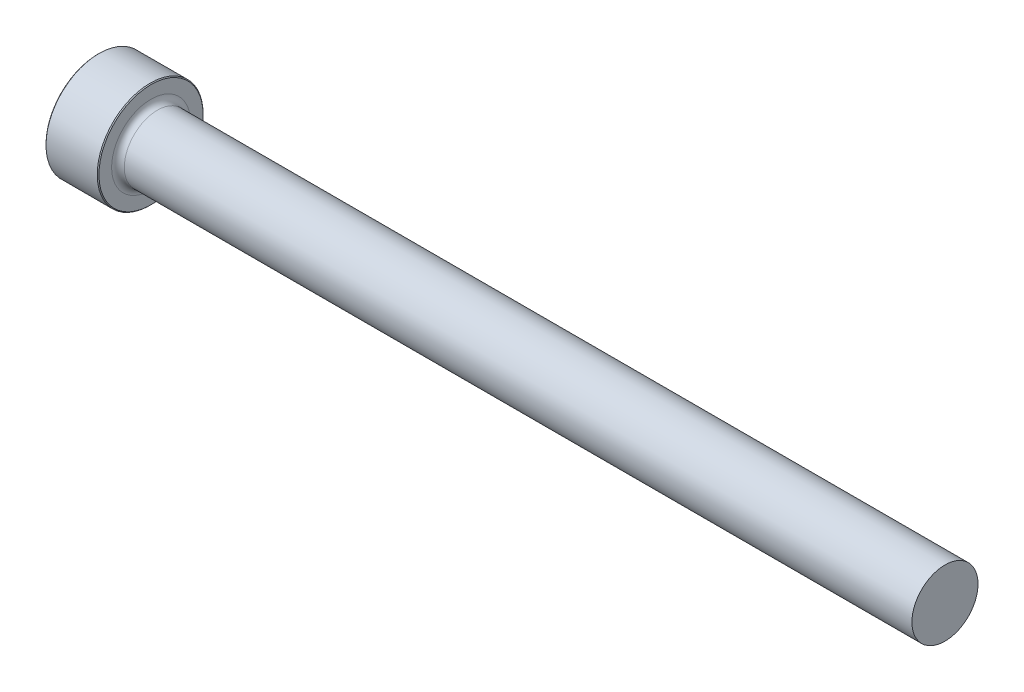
from build123d import *

# Parameters (mm, degrees)
CHAMFER1_SIZE = 0.1016


with BuildPart() as part:
    # Sketch1 → Revolve1 (revolve)
    with BuildSketch(Plane.XY):
        with BuildLine():
            Line((0, 0), (0, 6.35))
            Line((0, 6.35), (6.35, 6.35))
            Line((6.35, 6.35), (6.35, 4.72694))
            ThreePointArc((6.35, 4.72694), (6.573184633, 4.188124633), (7.112, 3.96494))
            Line((7.112, 3.96494), (101.6, 3.96494))
            Line((101.6, 3.96494), (101.6, 0))
            Line((101.6, 0), (0, 0))
        make_face()
    revolve(axis=Axis((101.6, 0, 0), (-1, 0, 0)))

    # Chamfer1
    chamfer1_edges = [part.edges().sort_by_distance(p)[0] for p in [
        (0, -6.35, 0),
        (6.35, -6.35, 0),
    ]]
    chamfer(chamfer1_edges, length=CHAMFER1_SIZE)


solid = part.part
